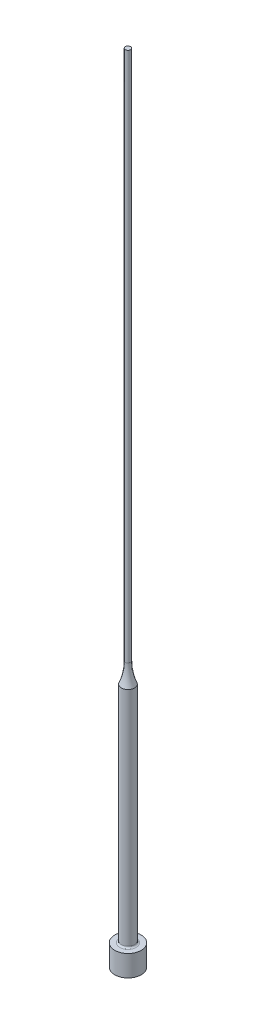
ISO-10303-21;
HEADER;
FILE_DESCRIPTION(('STEP AP214'),'2;1');
FILE_NAME('part.step','',(''),(''),'','','');
FILE_SCHEMA(('AUTOMOTIVE_DESIGN { 1 0 10303 214 1 1 1 1 }'));
ENDSEC;
DATA;
#1=APPLICATION_CONTEXT('core data for automotive mechanical design processes');
#2=APPLICATION_PROTOCOL_DEFINITION('international standard','automotive_design',2000,#1);
#3=PRODUCT_CONTEXT('',#1,'mechanical');
#4=PRODUCT('Part','Part','',(#3));
#5=PRODUCT_RELATED_PRODUCT_CATEGORY('part','',(#4));
#6=PRODUCT_DEFINITION_FORMATION('','',#4);
#7=PRODUCT_DEFINITION_CONTEXT('part definition',#1,'design');
#8=PRODUCT_DEFINITION('design','',#6,#7);
#9=PRODUCT_DEFINITION_SHAPE('','',#8);
#10=(LENGTH_UNIT() NAMED_UNIT(*) SI_UNIT(.MILLI.,.METRE.));
#11=(NAMED_UNIT(*) PLANE_ANGLE_UNIT() SI_UNIT($,.RADIAN.));
#12=(NAMED_UNIT(*) SI_UNIT($,.STERADIAN.) SOLID_ANGLE_UNIT());
#13=UNCERTAINTY_MEASURE_WITH_UNIT(LENGTH_MEASURE(1.E-05),#10,'distance_accuracy_value','');
#14=(GEOMETRIC_REPRESENTATION_CONTEXT(3) GLOBAL_UNCERTAINTY_ASSIGNED_CONTEXT((#13)) GLOBAL_UNIT_ASSIGNED_CONTEXT((#10,
#11,#12)) REPRESENTATION_CONTEXT('',''));
#15=CARTESIAN_POINT('',(0.,0.,0.));
#16=DIRECTION('',(0.,0.,1.));
#17=DIRECTION('',(1.,0.,0.));
#18=AXIS2_PLACEMENT_3D('',#15,#16,#17);
#19=CARTESIAN_POINT('',(0.500000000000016,150.,0.));
#20=DIRECTION('',(0.,-1.,0.));
#21=DIRECTION('',(1.,0.,0.));
#22=AXIS2_PLACEMENT_3D('',#19,#20,#21);
#23=PLANE('',#22);
#24=CARTESIAN_POINT('',(0.,150.,0.));
#25=DIRECTION('',(0.,1.,0.));
#26=DIRECTION('',(-1.,0.,0.));
#27=AXIS2_PLACEMENT_3D('',#24,#25,#26);
#28=CIRCLE('',#27,0.500000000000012);
#29=CARTESIAN_POINT('',(-0.500000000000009,150.,0.));
#30=VERTEX_POINT('',#29);
#31=EDGE_CURVE('E10',#30,#30,#28,.T.);
#32=ORIENTED_EDGE('',*,*,#31,.T.);
#33=EDGE_LOOP('',(#32));
#34=FACE_BOUND('',#33,.T.);
#35=ADVANCED_FACE('F30',(#34),#23,.F.);
#36=CARTESIAN_POINT('',(0.,150.,0.));
#37=DIRECTION('',(0.,1.,0.));
#38=DIRECTION('',(-1.,0.,0.));
#39=AXIS2_PLACEMENT_3D('',#36,#37,#38);
#40=CYLINDRICAL_SURFACE('',#39,0.50000000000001);
#41=ORIENTED_EDGE('',*,*,#31,.F.);
#42=EDGE_LOOP('',(#41));
#43=FACE_BOUND('',#42,.T.);
#44=CARTESIAN_POINT('',(0.,50.,0.));
#45=DIRECTION('',(0.,1.,0.));
#46=DIRECTION('',(-1.,0.,0.));
#47=AXIS2_PLACEMENT_3D('',#44,#45,#46);
#48=CIRCLE('',#47,0.500000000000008);
#49=CARTESIAN_POINT('',(-0.500000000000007,50.,0.));
#50=VERTEX_POINT('',#49);
#51=EDGE_CURVE('E36',#50,#50,#48,.T.);
#52=ORIENTED_EDGE('',*,*,#51,.T.);
#53=EDGE_LOOP('',(#52));
#54=FACE_BOUND('',#53,.T.);
#55=ADVANCED_FACE('F71',(#43,#54),#40,.T.);
#56=CARTESIAN_POINT('',(0.,50.,0.));
#57=DIRECTION('',(0.,1.,0.));
#58=DIRECTION('',(-1.,0.,0.));
#59=AXIS2_PLACEMENT_3D('',#56,#57,#58);
#60=TOROIDAL_SURFACE('',#59,10.5,10.);
#61=ORIENTED_EDGE('',*,*,#51,.F.);
#62=EDGE_LOOP('',(#61));
#63=FACE_BOUND('',#62,.T.);
#64=CARTESIAN_POINT('',(0.,46.2003289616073,0.));
#65=DIRECTION('',(0.,1.,0.));
#66=DIRECTION('',(-1.,0.,0.));
#67=AXIS2_PLACEMENT_3D('',#64,#65,#66);
#68=CIRCLE('',#67,1.25000000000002);
#69=CARTESIAN_POINT('',(-1.25000000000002,46.2003289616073,0.));
#70=VERTEX_POINT('',#69);
#71=EDGE_CURVE('E40',#70,#70,#68,.T.);
#72=ORIENTED_EDGE('',*,*,#71,.T.);
#73=EDGE_LOOP('',(#72));
#74=FACE_BOUND('',#73,.T.);
#75=ADVANCED_FACE('F75',(#63,#74),#60,.F.);
#76=CARTESIAN_POINT('',(0.,150.,0.));
#77=DIRECTION('',(0.,1.,0.));
#78=DIRECTION('',(-1.,0.,0.));
#79=AXIS2_PLACEMENT_3D('',#76,#77,#78);
#80=CYLINDRICAL_SURFACE('',#79,1.25000000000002);
#81=ORIENTED_EDGE('',*,*,#71,.F.);
#82=EDGE_LOOP('',(#81));
#83=FACE_BOUND('',#82,.T.);
#84=CARTESIAN_POINT('',(0.,4.3,0.));
#85=DIRECTION('',(0.,1.,0.));
#86=DIRECTION('',(-1.,0.,0.));
#87=AXIS2_PLACEMENT_3D('',#84,#85,#86);
#88=CIRCLE('',#87,1.25000000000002);
#89=CARTESIAN_POINT('',(-1.25000000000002,4.3,0.));
#90=VERTEX_POINT('',#89);
#91=EDGE_CURVE('E44',#90,#90,#88,.T.);
#92=ORIENTED_EDGE('',*,*,#91,.T.);
#93=EDGE_LOOP('',(#92));
#94=FACE_BOUND('',#93,.T.);
#95=ADVANCED_FACE('F80',(#83,#94),#80,.T.);
#96=CARTESIAN_POINT('',(0.,4.3,0.));
#97=DIRECTION('',(0.,1.,0.));
#98=DIRECTION('',(-1.,0.,0.));
#99=AXIS2_PLACEMENT_3D('',#96,#97,#98);
#100=TOROIDAL_SURFACE('',#99,1.55000000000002,0.3);
#101=ORIENTED_EDGE('',*,*,#91,.F.);
#102=EDGE_LOOP('',(#101));
#103=FACE_BOUND('',#102,.T.);
#104=CARTESIAN_POINT('',(0.,4.,0.));
#105=DIRECTION('',(0.,1.,0.));
#106=DIRECTION('',(-1.,0.,0.));
#107=AXIS2_PLACEMENT_3D('',#104,#105,#106);
#108=CIRCLE('',#107,1.55000000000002);
#109=CARTESIAN_POINT('',(-1.55000000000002,4.,0.));
#110=VERTEX_POINT('',#109);
#111=EDGE_CURVE('E49',#110,#110,#108,.T.);
#112=ORIENTED_EDGE('',*,*,#111,.T.);
#113=EDGE_LOOP('',(#112));
#114=FACE_BOUND('',#113,.T.);
#115=ADVANCED_FACE('F86',(#103,#114),#100,.F.);
#116=CARTESIAN_POINT('',(2.50000000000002,4.,0.));
#117=DIRECTION('',(0.,-1.,0.));
#118=DIRECTION('',(1.,0.,0.));
#119=AXIS2_PLACEMENT_3D('',#116,#117,#118);
#120=PLANE('',#119);
#121=ORIENTED_EDGE('',*,*,#111,.F.);
#122=EDGE_LOOP('',(#121));
#123=FACE_BOUND('',#122,.T.);
#124=CARTESIAN_POINT('',(0.,4.,0.));
#125=DIRECTION('',(0.,1.,0.));
#126=DIRECTION('',(-1.,0.,0.));
#127=AXIS2_PLACEMENT_3D('',#124,#125,#126);
#128=CIRCLE('',#127,2.50000000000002);
#129=CARTESIAN_POINT('',(-2.50000000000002,4.,0.));
#130=VERTEX_POINT('',#129);
#131=EDGE_CURVE('E52',#130,#130,#128,.T.);
#132=ORIENTED_EDGE('',*,*,#131,.T.);
#133=EDGE_LOOP('',(#132));
#134=FACE_BOUND('',#133,.T.);
#135=ADVANCED_FACE('F67',(#123,#134),#120,.F.);
#136=CARTESIAN_POINT('',(0.,150.,0.));
#137=DIRECTION('',(0.,1.,0.));
#138=DIRECTION('',(-1.,0.,0.));
#139=AXIS2_PLACEMENT_3D('',#136,#137,#138);
#140=CYLINDRICAL_SURFACE('',#139,2.50000000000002);
#141=ORIENTED_EDGE('',*,*,#131,.F.);
#142=EDGE_LOOP('',(#141));
#143=FACE_BOUND('',#142,.T.);
#144=CARTESIAN_POINT('',(0.,0.,0.));
#145=DIRECTION('',(0.,1.,0.));
#146=DIRECTION('',(-1.,0.,0.));
#147=AXIS2_PLACEMENT_3D('',#144,#145,#146);
#148=CIRCLE('',#147,2.50000000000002);
#149=CARTESIAN_POINT('',(-2.50000000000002,0.,0.));
#150=VERTEX_POINT('',#149);
#151=EDGE_CURVE('E55',#150,#150,#148,.T.);
#152=ORIENTED_EDGE('',*,*,#151,.T.);
#153=EDGE_LOOP('',(#152));
#154=FACE_BOUND('',#153,.T.);
#155=ADVANCED_FACE('F59',(#143,#154),#140,.T.);
#156=CARTESIAN_POINT('',(0.,0.,0.));
#157=DIRECTION('',(0.,1.,0.));
#158=DIRECTION('',(-1.,0.,0.));
#159=AXIS2_PLACEMENT_3D('',#156,#157,#158);
#160=PLANE('',#159);
#161=ORIENTED_EDGE('',*,*,#151,.F.);
#162=EDGE_LOOP('',(#161));
#163=FACE_BOUND('',#162,.T.);
#164=ADVANCED_FACE('F61',(#163),#160,.F.);
#165=CLOSED_SHELL('',(#35,#55,#75,#95,#115,#135,#155,#164));
#166=MANIFOLD_SOLID_BREP('B2',#165);
#167=ADVANCED_BREP_SHAPE_REPRESENTATION('',(#18,#166),#14);
#168=SHAPE_DEFINITION_REPRESENTATION(#9,#167);
ENDSEC;
END-ISO-10303-21;
